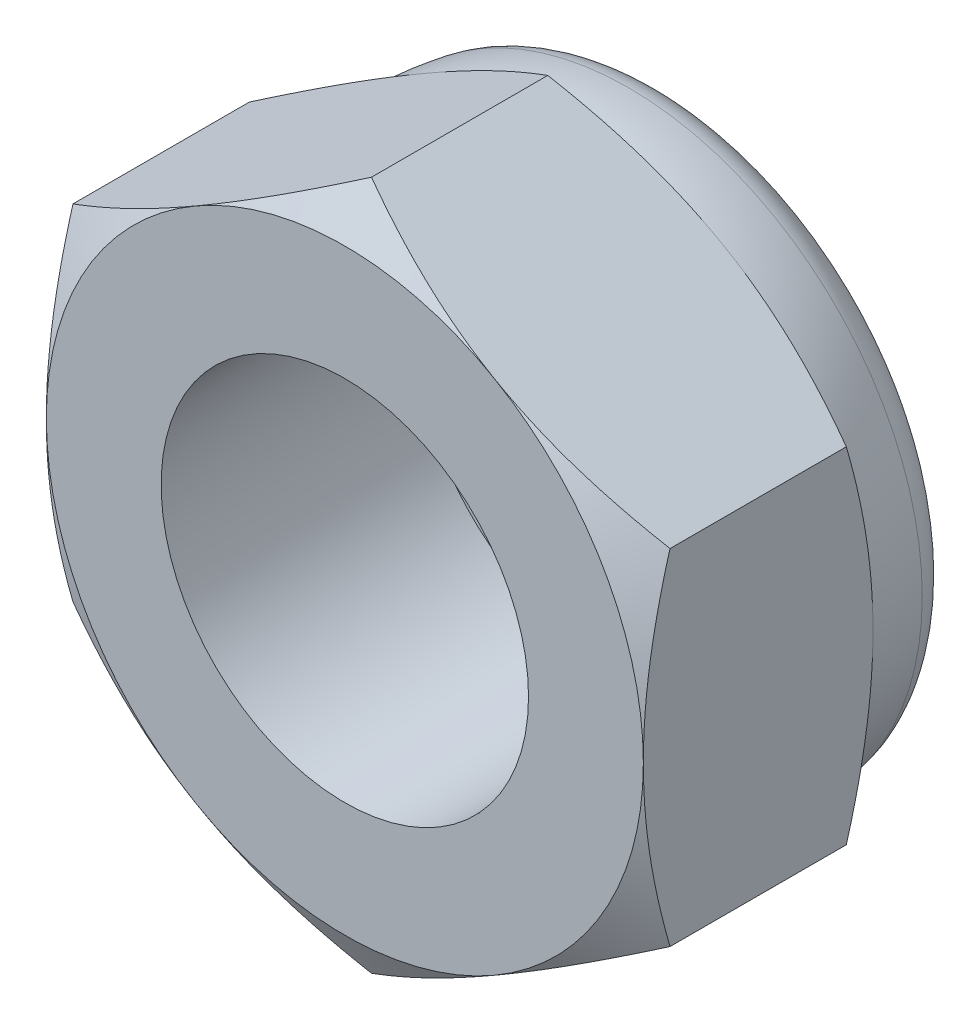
from build123d import *

# Parameters (mm, degrees)
BASE_EXTRUSION_DEPTH    = 5
ENL_V_MAT_EXTRU_2_DEPTH = 13.148388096
CONG_1_R                = 1
ESQUISSE3_R             = 4
ENL_V_MAT_EXTRU_1_DEPTH = 13.148388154
ESQUISSE6_W             = 0.5
ESQUISSE6_H             = 1.5


with BuildPart() as part:
    # Esquisse1 → Base-Extrusion (new body)
    with BuildSketch(Plane.XY):
        Polygon((6.5, -3.75277675), (6.5, 3.75277675), (0, 7.505553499), (-6.5, 3.75277675), (-6.5, -3.75277675), (0, -7.505553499), align=None)
    extrude(amount=-BASE_EXTRUSION_DEPTH)

    # Esquisse2 → Enl_vement de mati_re-R_volution1 (revolve, cut)
    with BuildSketch(Plane(origin=(0, 0, 0), x_dir=(1, 0, 0), z_dir=(0, 1, 0))):
        Polygon((-6.5, 0), (-11.830127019, 0), (-11.830127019, 5), (-6.5, 5), (-10.830127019, 2.5), align=None)
    revolve(axis=Axis((0, 0, -5), (0, 0, 1)), mode=Mode.SUBTRACT)

    # Esquisse4 → Boss.-R_vol.1 (revolve)
    with BuildSketch(Plane(origin=(0, 0, 0), x_dir=(1, 0, 0), z_dir=(0, 1, 0))):
        with BuildLine():
            Line((0, 11.5), (0, 5))
            Line((0, 5), (-6.5, 5))
            ThreePointArc((-6.5, 5), (-4.596194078, 9.596194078), (0, 11.5))
        make_face()
    revolve(axis=Axis((0, 0, 0), (0, 0, -1)))

    # Esquisse5 → Enl_v. mat.-Extru.2 (cut, through all)
    with BuildSketch(Plane.XY.offset(-7)):
        with BuildLine():
            ThreePointArc((6.5, 0), (5.629165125, 3.25), (3.25, 5.629165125))
            ThreePointArc((3.25, 5.629165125), (0, 6.5), (-3.25, 5.629165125))
            ThreePointArc((-3.25, 5.629165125), (-5.629165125, 3.25), (-6.5, 0))
            ThreePointArc((-6.5, 0), (-5.629165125, -3.25), (-3.25, -5.629165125))
            ThreePointArc((-3.25, -5.629165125), (0, -6.5), (3.25, -5.629165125))
            ThreePointArc((3.25, -5.629165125), (5.629165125, -3.25), (6.5, 0))
        make_face()
    extrude(amount=-ENL_V_MAT_EXTRU_2_DEPTH, mode=Mode.SUBTRACT)

    # Cong_1
    cong_1_edges = [part.edges().sort_by_distance(p)[0] for p in [
        (6.184658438, 0, -7),
    ]]
    fillet(cong_1_edges, radius=CONG_1_R)

    # Esquisse3 → Enl_v. mat.-Extru.1 (cut, through all)
    with BuildSketch(Plane.XY):
        Circle(ESQUISSE3_R)
    extrude(amount=-ENL_V_MAT_EXTRU_1_DEPTH, mode=Mode.SUBTRACT)

    # Esquisse6 → R_volution2 (revolve)
    with BuildSketch(Plane(origin=(0, 0, 0), x_dir=(1, 0, 0), z_dir=(0, 1, 0))):
        with Locations((3.75, 6.35)):
            Rectangle(ESQUISSE6_W, ESQUISSE6_H)
    revolve(axis=Axis((0, 0, -32.444892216), (0, 0, 1)))


solid = part.part
